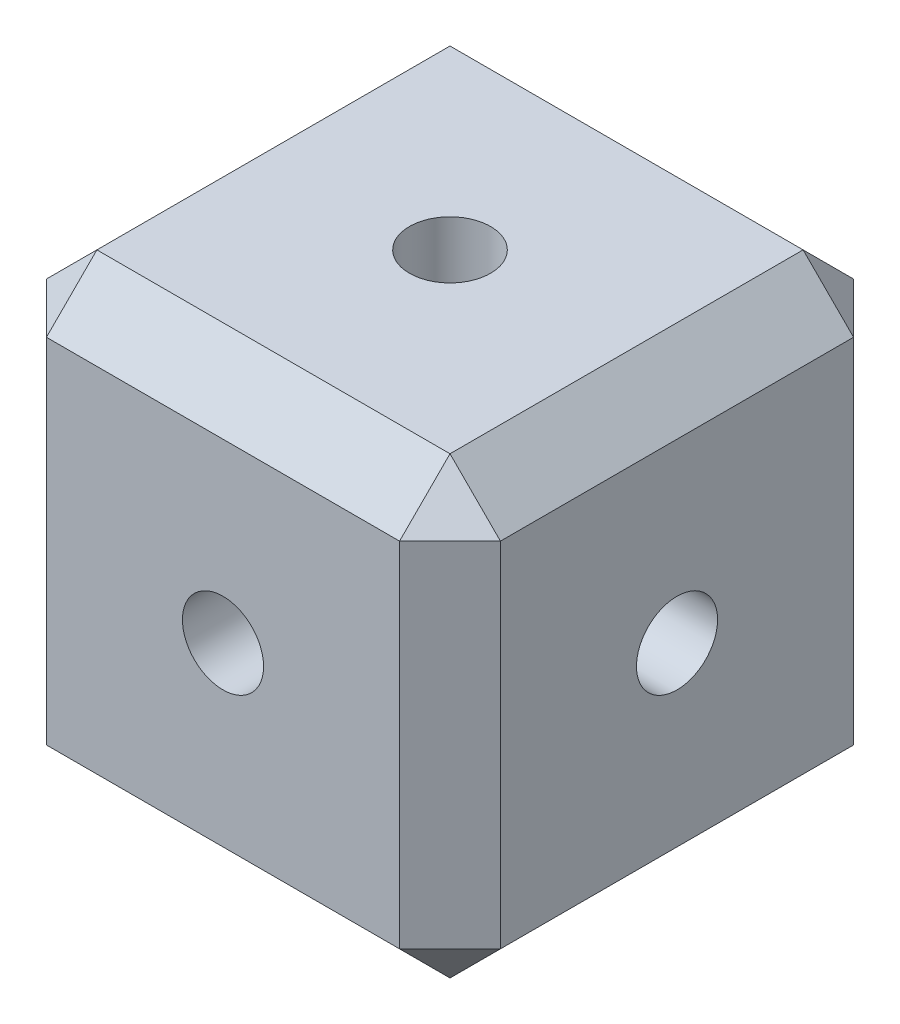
ISO-10303-21;
HEADER;
FILE_DESCRIPTION(('STEP AP214'),'2;1');
FILE_NAME('part.step','',(''),(''),'','','');
FILE_SCHEMA(('AUTOMOTIVE_DESIGN { 1 0 10303 214 1 1 1 1 }'));
ENDSEC;
DATA;
#1=APPLICATION_CONTEXT('core data for automotive mechanical design processes');
#2=APPLICATION_PROTOCOL_DEFINITION('international standard','automotive_design',2000,#1);
#3=PRODUCT_CONTEXT('',#1,'mechanical');
#4=PRODUCT('Part','Part','',(#3));
#5=PRODUCT_RELATED_PRODUCT_CATEGORY('part','',(#4));
#6=PRODUCT_DEFINITION_FORMATION('','',#4);
#7=PRODUCT_DEFINITION_CONTEXT('part definition',#1,'design');
#8=PRODUCT_DEFINITION('design','',#6,#7);
#9=PRODUCT_DEFINITION_SHAPE('','',#8);
#10=(LENGTH_UNIT() NAMED_UNIT(*) SI_UNIT(.MILLI.,.METRE.));
#11=(NAMED_UNIT(*) PLANE_ANGLE_UNIT() SI_UNIT($,.RADIAN.));
#12=(NAMED_UNIT(*) SI_UNIT($,.STERADIAN.) SOLID_ANGLE_UNIT());
#13=UNCERTAINTY_MEASURE_WITH_UNIT(LENGTH_MEASURE(1.E-05),#10,'distance_accuracy_value','');
#14=(GEOMETRIC_REPRESENTATION_CONTEXT(3) GLOBAL_UNCERTAINTY_ASSIGNED_CONTEXT((#13)) GLOBAL_UNIT_ASSIGNED_CONTEXT((#10,
#11,#12)) REPRESENTATION_CONTEXT('',''));
#15=CARTESIAN_POINT('',(0.,0.,0.));
#16=DIRECTION('',(0.,0.,1.));
#17=DIRECTION('',(1.,0.,0.));
#18=AXIS2_PLACEMENT_3D('',#15,#16,#17);
#19=CARTESIAN_POINT('',(14.2875,0.,0.));
#20=DIRECTION('',(1.,0.,0.));
#21=DIRECTION('',(0.,0.,-1.));
#22=AXIS2_PLACEMENT_3D('',#19,#20,#21);
#23=CYLINDRICAL_SURFACE('',#22,2.55269999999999);
#24=CARTESIAN_POINT('',(14.2875,0.,0.));
#25=DIRECTION('',(1.,0.,0.));
#26=DIRECTION('',(0.,0.,-1.));
#27=AXIS2_PLACEMENT_3D('',#24,#25,#26);
#28=CIRCLE('',#27,2.55269999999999);
#29=CARTESIAN_POINT('',(14.2875,0.,-2.55269999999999));
#30=VERTEX_POINT('',#29);
#31=EDGE_CURVE('E376',#30,#30,#28,.T.);
#32=ORIENTED_EDGE('',*,*,#31,.T.);
#33=EDGE_LOOP('',(#32));
#34=FACE_BOUND('',#33,.T.);
#35=CARTESIAN_POINT('',(0.,0.,0.));
#36=DIRECTION('',(0.707106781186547,0.,0.707106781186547));
#37=DIRECTION('',(0.707106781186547,0.,-0.707106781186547));
#38=AXIS2_PLACEMENT_3D('',#35,#36,#37);
#39=ELLIPSE('',#38,3.61006296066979,2.55269999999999);
#40=CARTESIAN_POINT('',(1.80503148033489,1.80503148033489,-1.80503148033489));
#41=VERTEX_POINT('',#40);
#42=CARTESIAN_POINT('',(1.80503148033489,-1.80503148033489,-1.80503148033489));
#43=VERTEX_POINT('',#42);
#44=EDGE_CURVE('E144',#41,#43,#39,.F.);
#45=ORIENTED_EDGE('',*,*,#44,.T.);
#46=CARTESIAN_POINT('',(0.,0.,0.));
#47=DIRECTION('',(0.707106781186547,0.707106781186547,0.));
#48=DIRECTION('',(0.707106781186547,-0.707106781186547,0.));
#49=AXIS2_PLACEMENT_3D('',#46,#47,#48);
#50=ELLIPSE('',#49,3.61006296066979,2.55269999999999);
#51=CARTESIAN_POINT('',(1.80503148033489,-1.80503148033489,1.80503148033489));
#52=VERTEX_POINT('',#51);
#53=EDGE_CURVE('E137',#43,#52,#50,.F.);
#54=ORIENTED_EDGE('',*,*,#53,.T.);
#55=CARTESIAN_POINT('',(0.,0.,0.));
#56=DIRECTION('',(0.707106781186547,0.,-0.707106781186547));
#57=DIRECTION('',(0.707106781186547,0.,0.707106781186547));
#58=AXIS2_PLACEMENT_3D('',#55,#56,#57);
#59=ELLIPSE('',#58,3.61006296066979,2.55269999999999);
#60=CARTESIAN_POINT('',(1.80503148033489,1.80503148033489,1.80503148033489));
#61=VERTEX_POINT('',#60);
#62=EDGE_CURVE('E161',#52,#61,#59,.F.);
#63=ORIENTED_EDGE('',*,*,#62,.T.);
#64=CARTESIAN_POINT('',(0.,0.,0.));
#65=DIRECTION('',(0.707106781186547,-0.707106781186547,0.));
#66=DIRECTION('',(0.707106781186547,0.707106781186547,0.));
#67=AXIS2_PLACEMENT_3D('',#64,#65,#66);
#68=ELLIPSE('',#67,3.61006296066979,2.55269999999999);
#69=EDGE_CURVE('E361',#61,#41,#68,.F.);
#70=ORIENTED_EDGE('',*,*,#69,.T.);
#71=EDGE_LOOP('',(#45,#54,#63,#70));
#72=FACE_BOUND('',#71,.T.);
#73=ADVANCED_FACE('F15',(#34,#72),#23,.F.);
#74=CARTESIAN_POINT('',(-14.2875,14.2875,14.2875));
#75=DIRECTION('',(1.,0.,0.));
#76=DIRECTION('',(0.,1.,0.));
#77=AXIS2_PLACEMENT_3D('',#74,#75,#76);
#78=PLANE('',#77);
#79=DIRECTION('',(0.,0.,-1.));
#80=VECTOR('',#79,1.);
#81=CARTESIAN_POINT('',(-14.2875,11.1125,14.2875));
#82=LINE('',#81,#80);
#83=CARTESIAN_POINT('',(-14.2875,11.1125,11.1125));
#84=VERTEX_POINT('',#83);
#85=CARTESIAN_POINT('',(-14.2875,11.1125,-11.1125));
#86=VERTEX_POINT('',#85);
#87=EDGE_CURVE('E178',#84,#86,#82,.T.);
#88=ORIENTED_EDGE('',*,*,#87,.T.);
#89=DIRECTION('',(0.,-1.,0.));
#90=VECTOR('',#89,1.);
#91=CARTESIAN_POINT('',(-14.2875,14.2875,-11.1125));
#92=LINE('',#91,#90);
#93=CARTESIAN_POINT('',(-14.2875,-11.1125,-11.1125));
#94=VERTEX_POINT('',#93);
#95=EDGE_CURVE('E187',#86,#94,#92,.T.);
#96=ORIENTED_EDGE('',*,*,#95,.T.);
#97=DIRECTION('',(0.,0.,1.));
#98=VECTOR('',#97,1.);
#99=CARTESIAN_POINT('',(-14.2875,-11.1125,14.2875));
#100=LINE('',#99,#98);
#101=CARTESIAN_POINT('',(-14.2875,-11.1125,11.1125));
#102=VERTEX_POINT('',#101);
#103=EDGE_CURVE('E184',#94,#102,#100,.T.);
#104=ORIENTED_EDGE('',*,*,#103,.T.);
#105=DIRECTION('',(0.,1.,0.));
#106=VECTOR('',#105,1.);
#107=CARTESIAN_POINT('',(-14.2875,14.2875,11.1125));
#108=LINE('',#107,#106);
#109=EDGE_CURVE('E181',#102,#84,#108,.T.);
#110=ORIENTED_EDGE('',*,*,#109,.T.);
#111=EDGE_LOOP('',(#88,#96,#104,#110));
#112=FACE_BOUND('',#111,.T.);
#113=CARTESIAN_POINT('',(-14.2875,0.,0.));
#114=DIRECTION('',(1.,0.,0.));
#115=DIRECTION('',(0.,0.,-1.));
#116=AXIS2_PLACEMENT_3D('',#113,#114,#115);
#117=CIRCLE('',#116,2.55269999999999);
#118=CARTESIAN_POINT('',(-14.2875,0.,-2.55269999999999));
#119=VERTEX_POINT('',#118);
#120=EDGE_CURVE('E170',#119,#119,#117,.T.);
#121=ORIENTED_EDGE('',*,*,#120,.T.);
#122=EDGE_LOOP('',(#121));
#123=FACE_BOUND('',#122,.T.);
#124=ADVANCED_FACE('F383',(#112,#123),#78,.F.);
#125=CARTESIAN_POINT('',(-14.2875,-14.2875,14.2875));
#126=DIRECTION('',(0.,1.,0.));
#127=DIRECTION('',(-1.,0.,0.));
#128=AXIS2_PLACEMENT_3D('',#125,#126,#127);
#129=PLANE('',#128);
#130=DIRECTION('',(-1.,0.,0.));
#131=VECTOR('',#130,1.);
#132=CARTESIAN_POINT('',(-14.2875,-14.2875,11.1125));
#133=LINE('',#132,#131);
#134=CARTESIAN_POINT('',(11.1125,-14.2875,11.1125));
#135=VERTEX_POINT('',#134);
#136=CARTESIAN_POINT('',(-11.1125,-14.2875,11.1125));
#137=VERTEX_POINT('',#136);
#138=EDGE_CURVE('E207',#135,#137,#133,.T.);
#139=ORIENTED_EDGE('',*,*,#138,.T.);
#140=DIRECTION('',(0.,0.,-1.));
#141=VECTOR('',#140,1.);
#142=CARTESIAN_POINT('',(-11.1125,-14.2875,14.2875));
#143=LINE('',#142,#141);
#144=CARTESIAN_POINT('',(-11.1125,-14.2875,-11.1125));
#145=VERTEX_POINT('',#144);
#146=EDGE_CURVE('E213',#137,#145,#143,.T.);
#147=ORIENTED_EDGE('',*,*,#146,.T.);
#148=DIRECTION('',(1.,0.,0.));
#149=VECTOR('',#148,1.);
#150=CARTESIAN_POINT('',(-14.2875,-14.2875,-11.1125));
#151=LINE('',#150,#149);
#152=CARTESIAN_POINT('',(11.1125,-14.2875,-11.1125));
#153=VERTEX_POINT('',#152);
#154=EDGE_CURVE('E210',#145,#153,#151,.T.);
#155=ORIENTED_EDGE('',*,*,#154,.T.);
#156=DIRECTION('',(0.,0.,1.));
#157=VECTOR('',#156,1.);
#158=CARTESIAN_POINT('',(11.1125,-14.2875,14.2875));
#159=LINE('',#158,#157);
#160=EDGE_CURVE('E204',#153,#135,#159,.T.);
#161=ORIENTED_EDGE('',*,*,#160,.T.);
#162=EDGE_LOOP('',(#139,#147,#155,#161));
#163=FACE_BOUND('',#162,.T.);
#164=CARTESIAN_POINT('',(0.,-14.2875,0.));
#165=DIRECTION('',(0.,1.,0.));
#166=DIRECTION('',(0.,0.,1.));
#167=AXIS2_PLACEMENT_3D('',#164,#165,#166);
#168=CIRCLE('',#167,2.55269999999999);
#169=CARTESIAN_POINT('',(0.,-14.2875,2.55269999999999));
#170=VERTEX_POINT('',#169);
#171=EDGE_CURVE('E156',#170,#170,#168,.T.);
#172=ORIENTED_EDGE('',*,*,#171,.T.);
#173=EDGE_LOOP('',(#172));
#174=FACE_BOUND('',#173,.T.);
#175=ADVANCED_FACE('F402',(#163,#174),#129,.F.);
#176=CARTESIAN_POINT('',(14.2875,14.2875,14.2875));
#177=DIRECTION('',(-1.,0.,0.));
#178=DIRECTION('',(0.,-1.,0.));
#179=AXIS2_PLACEMENT_3D('',#176,#177,#178);
#180=PLANE('',#179);
#181=DIRECTION('',(0.,-1.,0.));
#182=VECTOR('',#181,1.);
#183=CARTESIAN_POINT('',(14.2875,-14.2875,11.1125));
#184=LINE('',#183,#182);
#185=CARTESIAN_POINT('',(14.2875,11.1125,11.1125));
#186=VERTEX_POINT('',#185);
#187=CARTESIAN_POINT('',(14.2875,-11.1125,11.1125));
#188=VERTEX_POINT('',#187);
#189=EDGE_CURVE('E230',#186,#188,#184,.T.);
#190=ORIENTED_EDGE('',*,*,#189,.T.);
#191=DIRECTION('',(0.,0.,-1.));
#192=VECTOR('',#191,1.);
#193=CARTESIAN_POINT('',(14.2875,-11.1125,14.2875));
#194=LINE('',#193,#192);
#195=CARTESIAN_POINT('',(14.2875,-11.1125,-11.1125));
#196=VERTEX_POINT('',#195);
#197=EDGE_CURVE('E239',#188,#196,#194,.T.);
#198=ORIENTED_EDGE('',*,*,#197,.T.);
#199=DIRECTION('',(0.,1.,0.));
#200=VECTOR('',#199,1.);
#201=CARTESIAN_POINT('',(14.2875,14.2875,-11.1125));
#202=LINE('',#201,#200);
#203=CARTESIAN_POINT('',(14.2875,11.1125,-11.1125));
#204=VERTEX_POINT('',#203);
#205=EDGE_CURVE('E236',#196,#204,#202,.T.);
#206=ORIENTED_EDGE('',*,*,#205,.T.);
#207=DIRECTION('',(0.,0.,1.));
#208=VECTOR('',#207,1.);
#209=CARTESIAN_POINT('',(14.2875,11.1125,14.2875));
#210=LINE('',#209,#208);
#211=EDGE_CURVE('E233',#204,#186,#210,.T.);
#212=ORIENTED_EDGE('',*,*,#211,.T.);
#213=EDGE_LOOP('',(#190,#198,#206,#212));
#214=FACE_BOUND('',#213,.T.);
#215=ORIENTED_EDGE('',*,*,#31,.F.);
#216=EDGE_LOOP('',(#215));
#217=FACE_BOUND('',#216,.T.);
#218=ADVANCED_FACE('F465',(#214,#217),#180,.F.);
#219=CARTESIAN_POINT('',(-14.2875,14.2875,14.2875));
#220=DIRECTION('',(0.,-1.,0.));
#221=DIRECTION('',(0.,0.,-1.));
#222=AXIS2_PLACEMENT_3D('',#219,#220,#221);
#223=PLANE('',#222);
#224=DIRECTION('',(0.,0.,-1.));
#225=VECTOR('',#224,1.);
#226=CARTESIAN_POINT('',(11.1125,14.2875,14.2875));
#227=LINE('',#226,#225);
#228=CARTESIAN_POINT('',(11.1125,14.2875,11.1125));
#229=VERTEX_POINT('',#228);
#230=CARTESIAN_POINT('',(11.1125,14.2875,-11.1125));
#231=VERTEX_POINT('',#230);
#232=EDGE_CURVE('E25',#229,#231,#227,.T.);
#233=ORIENTED_EDGE('',*,*,#232,.T.);
#234=DIRECTION('',(-1.,0.,0.));
#235=VECTOR('',#234,1.);
#236=CARTESIAN_POINT('',(-14.2875,14.2875,-11.1125));
#237=LINE('',#236,#235);
#238=CARTESIAN_POINT('',(-11.1125,14.2875,-11.1125));
#239=VERTEX_POINT('',#238);
#240=EDGE_CURVE('E10',#231,#239,#237,.T.);
#241=ORIENTED_EDGE('',*,*,#240,.T.);
#242=DIRECTION('',(0.,0.,1.));
#243=VECTOR('',#242,1.);
#244=CARTESIAN_POINT('',(-11.1125,14.2875,14.2875));
#245=LINE('',#244,#243);
#246=CARTESIAN_POINT('',(-11.1125,14.2875,11.1125));
#247=VERTEX_POINT('',#246);
#248=EDGE_CURVE('E246',#239,#247,#245,.T.);
#249=ORIENTED_EDGE('',*,*,#248,.T.);
#250=DIRECTION('',(1.,0.,0.));
#251=VECTOR('',#250,1.);
#252=CARTESIAN_POINT('',(14.2875,14.2875,11.1125));
#253=LINE('',#252,#251);
#254=EDGE_CURVE('E243',#247,#229,#253,.T.);
#255=ORIENTED_EDGE('',*,*,#254,.T.);
#256=EDGE_LOOP('',(#233,#241,#249,#255));
#257=FACE_BOUND('',#256,.T.);
#258=CARTESIAN_POINT('',(0.,14.2875,0.));
#259=DIRECTION('',(0.,1.,0.));
#260=DIRECTION('',(0.,0.,1.));
#261=AXIS2_PLACEMENT_3D('',#258,#259,#260);
#262=CIRCLE('',#261,2.55269999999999);
#263=CARTESIAN_POINT('',(0.,14.2875,2.55269999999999));
#264=VERTEX_POINT('',#263);
#265=EDGE_CURVE('E339',#264,#264,#262,.T.);
#266=ORIENTED_EDGE('',*,*,#265,.F.);
#267=EDGE_LOOP('',(#266));
#268=FACE_BOUND('',#267,.T.);
#269=ADVANCED_FACE('F455',(#257,#268),#223,.F.);
#270=CARTESIAN_POINT('',(0.,0.,14.2875));
#271=DIRECTION('',(0.,0.,1.));
#272=DIRECTION('',(1.,0.,0.));
#273=AXIS2_PLACEMENT_3D('',#270,#271,#272);
#274=PLANE('',#273);
#275=DIRECTION('',(0.,-1.,0.));
#276=VECTOR('',#275,1.);
#277=CARTESIAN_POINT('',(-11.1125,-14.2875,14.2875));
#278=LINE('',#277,#276);
#279=CARTESIAN_POINT('',(-11.1125,11.1125,14.2875));
#280=VERTEX_POINT('',#279);
#281=CARTESIAN_POINT('',(-11.1125,-11.1125,14.2875));
#282=VERTEX_POINT('',#281);
#283=EDGE_CURVE('E220',#280,#282,#278,.T.);
#284=ORIENTED_EDGE('',*,*,#283,.T.);
#285=DIRECTION('',(1.,0.,0.));
#286=VECTOR('',#285,1.);
#287=CARTESIAN_POINT('',(14.2875,-11.1125,14.2875));
#288=LINE('',#287,#286);
#289=CARTESIAN_POINT('',(11.1125,-11.1125,14.2875));
#290=VERTEX_POINT('',#289);
#291=EDGE_CURVE('E226',#282,#290,#288,.T.);
#292=ORIENTED_EDGE('',*,*,#291,.T.);
#293=DIRECTION('',(0.,1.,0.));
#294=VECTOR('',#293,1.);
#295=CARTESIAN_POINT('',(11.1125,14.2875,14.2875));
#296=LINE('',#295,#294);
#297=CARTESIAN_POINT('',(11.1125,11.1125,14.2875));
#298=VERTEX_POINT('',#297);
#299=EDGE_CURVE('E223',#290,#298,#296,.T.);
#300=ORIENTED_EDGE('',*,*,#299,.T.);
#301=DIRECTION('',(-1.,0.,0.));
#302=VECTOR('',#301,1.);
#303=CARTESIAN_POINT('',(-14.2875,11.1125,14.2875));
#304=LINE('',#303,#302);
#305=EDGE_CURVE('E217',#298,#280,#304,.T.);
#306=ORIENTED_EDGE('',*,*,#305,.T.);
#307=EDGE_LOOP('',(#284,#292,#300,#306));
#308=FACE_BOUND('',#307,.T.);
#309=CARTESIAN_POINT('',(0.,0.,14.2875));
#310=DIRECTION('',(0.,0.,1.));
#311=DIRECTION('',(1.,0.,0.));
#312=AXIS2_PLACEMENT_3D('',#309,#310,#311);
#313=CIRCLE('',#312,2.55269999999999);
#314=CARTESIAN_POINT('',(2.55269999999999,0.,14.2875));
#315=VERTEX_POINT('',#314);
#316=EDGE_CURVE('E369',#315,#315,#313,.T.);
#317=ORIENTED_EDGE('',*,*,#316,.F.);
#318=EDGE_LOOP('',(#317));
#319=FACE_BOUND('',#318,.T.);
#320=ADVANCED_FACE('F394',(#308,#319),#274,.T.);
#321=CARTESIAN_POINT('',(0.,0.,-14.2875));
#322=DIRECTION('',(0.,0.,1.));
#323=DIRECTION('',(1.,0.,0.));
#324=AXIS2_PLACEMENT_3D('',#321,#322,#323);
#325=PLANE('',#324);
#326=DIRECTION('',(-1.,0.,0.));
#327=VECTOR('',#326,1.);
#328=CARTESIAN_POINT('',(0.,-11.1125,-14.2875));
#329=LINE('',#328,#327);
#330=CARTESIAN_POINT('',(11.1125,-11.1125,-14.2875));
#331=VERTEX_POINT('',#330);
#332=CARTESIAN_POINT('',(-11.1125,-11.1125,-14.2875));
#333=VERTEX_POINT('',#332);
#334=EDGE_CURVE('E197',#331,#333,#329,.T.);
#335=ORIENTED_EDGE('',*,*,#334,.T.);
#336=DIRECTION('',(0.,1.,0.));
#337=VECTOR('',#336,1.);
#338=CARTESIAN_POINT('',(-11.1125,0.,-14.2875));
#339=LINE('',#338,#337);
#340=CARTESIAN_POINT('',(-11.1125,11.1125,-14.2875));
#341=VERTEX_POINT('',#340);
#342=EDGE_CURVE('E200',#333,#341,#339,.T.);
#343=ORIENTED_EDGE('',*,*,#342,.T.);
#344=DIRECTION('',(1.,0.,0.));
#345=VECTOR('',#344,1.);
#346=CARTESIAN_POINT('',(0.,11.1125,-14.2875));
#347=LINE('',#346,#345);
#348=CARTESIAN_POINT('',(11.1125,11.1125,-14.2875));
#349=VERTEX_POINT('',#348);
#350=EDGE_CURVE('E191',#341,#349,#347,.T.);
#351=ORIENTED_EDGE('',*,*,#350,.T.);
#352=DIRECTION('',(0.,-1.,0.));
#353=VECTOR('',#352,1.);
#354=CARTESIAN_POINT('',(11.1125,0.,-14.2875));
#355=LINE('',#354,#353);
#356=EDGE_CURVE('E194',#349,#331,#355,.T.);
#357=ORIENTED_EDGE('',*,*,#356,.T.);
#358=EDGE_LOOP('',(#335,#343,#351,#357));
#359=FACE_BOUND('',#358,.T.);
#360=CARTESIAN_POINT('',(0.,0.,-14.2875));
#361=DIRECTION('',(0.,0.,1.));
#362=DIRECTION('',(1.,0.,0.));
#363=AXIS2_PLACEMENT_3D('',#360,#361,#362);
#364=CIRCLE('',#363,2.55269999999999);
#365=CARTESIAN_POINT('',(2.55269999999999,0.,-14.2875));
#366=VERTEX_POINT('',#365);
#367=EDGE_CURVE('E373',#366,#366,#364,.T.);
#368=ORIENTED_EDGE('',*,*,#367,.T.);
#369=EDGE_LOOP('',(#368));
#370=FACE_BOUND('',#369,.T.);
#371=ADVANCED_FACE('F386',(#359,#370),#325,.F.);
#372=CARTESIAN_POINT('',(0.,0.,0.));
#373=DIRECTION('',(0.707106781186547,0.,-0.707106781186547));
#374=DIRECTION('',(0.707106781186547,0.,0.707106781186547));
#375=AXIS2_PLACEMENT_3D('',#372,#373,#374);
#376=ELLIPSE('',#375,3.61006296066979,2.55269999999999);
#377=CARTESIAN_POINT('',(-1.80503148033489,-1.80503148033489,-1.80503148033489));
#378=VERTEX_POINT('',#377);
#379=CARTESIAN_POINT('',(-1.80503148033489,1.80503148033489,-1.80503148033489));
#380=VERTEX_POINT('',#379);
#381=EDGE_CURVE('E152',#378,#380,#376,.T.);
#382=ORIENTED_EDGE('',*,*,#381,.T.);
#383=CARTESIAN_POINT('',(0.,0.,0.));
#384=DIRECTION('',(0.707106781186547,0.707106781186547,0.));
#385=DIRECTION('',(0.707106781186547,-0.707106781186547,0.));
#386=AXIS2_PLACEMENT_3D('',#383,#384,#385);
#387=ELLIPSE('',#386,3.61006296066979,2.55269999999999);
#388=CARTESIAN_POINT('',(-1.80503148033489,1.80503148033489,1.80503148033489));
#389=VERTEX_POINT('',#388);
#390=EDGE_CURVE('E358',#380,#389,#387,.T.);
#391=ORIENTED_EDGE('',*,*,#390,.T.);
#392=CARTESIAN_POINT('',(0.,0.,0.));
#393=DIRECTION('',(0.707106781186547,0.,0.707106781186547));
#394=DIRECTION('',(0.707106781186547,0.,-0.707106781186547));
#395=AXIS2_PLACEMENT_3D('',#392,#393,#394);
#396=ELLIPSE('',#395,3.61006296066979,2.55269999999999);
#397=CARTESIAN_POINT('',(-1.80503148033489,-1.80503148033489,1.80503148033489));
#398=VERTEX_POINT('',#397);
#399=EDGE_CURVE('E154',#389,#398,#396,.T.);
#400=ORIENTED_EDGE('',*,*,#399,.T.);
#401=CARTESIAN_POINT('',(0.,0.,0.));
#402=DIRECTION('',(0.707106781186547,-0.707106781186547,0.));
#403=DIRECTION('',(0.707106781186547,0.707106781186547,0.));
#404=AXIS2_PLACEMENT_3D('',#401,#402,#403);
#405=ELLIPSE('',#404,3.61006296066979,2.55269999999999);
#406=EDGE_CURVE('E134',#398,#378,#405,.T.);
#407=ORIENTED_EDGE('',*,*,#406,.T.);
#408=EDGE_LOOP('',(#382,#391,#400,#407));
#409=FACE_BOUND('',#408,.T.);
#410=ORIENTED_EDGE('',*,*,#120,.F.);
#411=EDGE_LOOP('',(#410));
#412=FACE_BOUND('',#411,.T.);
#413=ADVANCED_FACE('F149',(#409,#412),#23,.F.);
#414=CARTESIAN_POINT('',(0.,0.,14.2875));
#415=DIRECTION('',(0.,0.,1.));
#416=DIRECTION('',(1.,0.,0.));
#417=AXIS2_PLACEMENT_3D('',#414,#415,#416);
#418=CYLINDRICAL_SURFACE('',#417,2.55269999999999);
#419=ORIENTED_EDGE('',*,*,#316,.T.);
#420=EDGE_LOOP('',(#419));
#421=FACE_BOUND('',#420,.T.);
#422=ORIENTED_EDGE('',*,*,#62,.F.);
#423=CARTESIAN_POINT('',(0.,0.,0.));
#424=DIRECTION('',(0.,0.707106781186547,0.707106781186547));
#425=DIRECTION('',(0.,-0.707106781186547,0.707106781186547));
#426=AXIS2_PLACEMENT_3D('',#423,#424,#425);
#427=ELLIPSE('',#426,3.61006296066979,2.55269999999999);
#428=EDGE_CURVE('E355',#52,#398,#427,.F.);
#429=ORIENTED_EDGE('',*,*,#428,.T.);
#430=ORIENTED_EDGE('',*,*,#399,.F.);
#431=CARTESIAN_POINT('',(0.,0.,0.));
#432=DIRECTION('',(0.,-0.707106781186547,0.707106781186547));
#433=DIRECTION('',(0.,0.707106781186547,0.707106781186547));
#434=AXIS2_PLACEMENT_3D('',#431,#432,#433);
#435=ELLIPSE('',#434,3.61006296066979,2.55269999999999);
#436=EDGE_CURVE('E365',#389,#61,#435,.F.);
#437=ORIENTED_EDGE('',*,*,#436,.T.);
#438=EDGE_LOOP('',(#422,#429,#430,#437));
#439=FACE_BOUND('',#438,.T.);
#440=ADVANCED_FACE('F385',(#421,#439),#418,.F.);
#441=ORIENTED_EDGE('',*,*,#367,.F.);
#442=EDGE_LOOP('',(#441));
#443=FACE_BOUND('',#442,.T.);
#444=ORIENTED_EDGE('',*,*,#44,.F.);
#445=CARTESIAN_POINT('',(0.,0.,0.));
#446=DIRECTION('',(0.,0.707106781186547,0.707106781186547));
#447=DIRECTION('',(0.,-0.707106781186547,0.707106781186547));
#448=AXIS2_PLACEMENT_3D('',#445,#446,#447);
#449=ELLIPSE('',#448,3.61006296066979,2.55269999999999);
#450=EDGE_CURVE('E143',#41,#380,#449,.T.);
#451=ORIENTED_EDGE('',*,*,#450,.T.);
#452=ORIENTED_EDGE('',*,*,#381,.F.);
#453=CARTESIAN_POINT('',(0.,0.,0.));
#454=DIRECTION('',(0.,-0.707106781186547,0.707106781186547));
#455=DIRECTION('',(0.,0.707106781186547,0.707106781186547));
#456=AXIS2_PLACEMENT_3D('',#453,#454,#455);
#457=ELLIPSE('',#456,3.61006296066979,2.55269999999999);
#458=EDGE_CURVE('E131',#378,#43,#457,.T.);
#459=ORIENTED_EDGE('',*,*,#458,.T.);
#460=EDGE_LOOP('',(#444,#451,#452,#459));
#461=FACE_BOUND('',#460,.T.);
#462=ADVANCED_FACE('F159',(#443,#461),#418,.F.);
#463=CARTESIAN_POINT('',(0.,14.2875,0.));
#464=DIRECTION('',(0.,1.,0.));
#465=DIRECTION('',(0.,0.,1.));
#466=AXIS2_PLACEMENT_3D('',#463,#464,#465);
#467=CYLINDRICAL_SURFACE('',#466,2.55269999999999);
#468=ORIENTED_EDGE('',*,*,#265,.T.);
#469=EDGE_LOOP('',(#468));
#470=FACE_BOUND('',#469,.T.);
#471=ORIENTED_EDGE('',*,*,#390,.F.);
#472=ORIENTED_EDGE('',*,*,#450,.F.);
#473=ORIENTED_EDGE('',*,*,#69,.F.);
#474=ORIENTED_EDGE('',*,*,#436,.F.);
#475=EDGE_LOOP('',(#471,#472,#473,#474));
#476=FACE_BOUND('',#475,.T.);
#477=ADVANCED_FACE('F409',(#470,#476),#467,.F.);
#478=ORIENTED_EDGE('',*,*,#171,.F.);
#479=EDGE_LOOP('',(#478));
#480=FACE_BOUND('',#479,.T.);
#481=ORIENTED_EDGE('',*,*,#53,.F.);
#482=ORIENTED_EDGE('',*,*,#458,.F.);
#483=ORIENTED_EDGE('',*,*,#406,.F.);
#484=ORIENTED_EDGE('',*,*,#428,.F.);
#485=EDGE_LOOP('',(#481,#482,#483,#484));
#486=FACE_BOUND('',#485,.T.);
#487=ADVANCED_FACE('F133',(#480,#486),#467,.F.);
#488=CARTESIAN_POINT('',(11.1125,0.,14.2875));
#489=DIRECTION('',(0.707106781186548,0.,0.707106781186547));
#490=DIRECTION('',(0.,-1.,0.));
#491=AXIS2_PLACEMENT_3D('',#488,#489,#490);
#492=PLANE('',#491);
#493=DIRECTION('',(0.707106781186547,0.,-0.707106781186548));
#494=VECTOR('',#493,1.);
#495=CARTESIAN_POINT('',(14.2875,11.1125,11.1125));
#496=LINE('',#495,#494);
#497=EDGE_CURVE('E19',#298,#186,#496,.T.);
#498=ORIENTED_EDGE('',*,*,#497,.F.);
#499=ORIENTED_EDGE('',*,*,#299,.F.);
#500=DIRECTION('',(-0.707106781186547,0.,0.707106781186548));
#501=VECTOR('',#500,1.);
#502=CARTESIAN_POINT('',(11.1125,-11.1125,14.2875));
#503=LINE('',#502,#501);
#504=EDGE_CURVE('E329',#188,#290,#503,.T.);
#505=ORIENTED_EDGE('',*,*,#504,.F.);
#506=ORIENTED_EDGE('',*,*,#189,.F.);
#507=EDGE_LOOP('',(#498,#499,#505,#506));
#508=FACE_BOUND('',#507,.T.);
#509=ADVANCED_FACE('F17',(#508),#492,.T.);
#510=CARTESIAN_POINT('',(14.2875,11.1125,11.1125));
#511=DIRECTION('',(0.577350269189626,0.577350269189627,0.577350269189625));
#512=DIRECTION('',(-0.707106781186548,0.707106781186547,0.));
#513=AXIS2_PLACEMENT_3D('',#510,#511,#512);
#514=PLANE('',#513);
#515=DIRECTION('',(0.,-0.707106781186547,0.707106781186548));
#516=VECTOR('',#515,1.);
#517=CARTESIAN_POINT('',(11.1125,12.7,12.7));
#518=LINE('',#517,#516);
#519=EDGE_CURVE('E322',#298,#229,#518,.F.);
#520=ORIENTED_EDGE('',*,*,#519,.F.);
#521=ORIENTED_EDGE('',*,*,#497,.T.);
#522=DIRECTION('',(0.707106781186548,-0.707106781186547,0.));
#523=VECTOR('',#522,1.);
#524=CARTESIAN_POINT('',(14.2875,11.1125,11.1125));
#525=LINE('',#524,#523);
#526=EDGE_CURVE('E326',#229,#186,#525,.T.);
#527=ORIENTED_EDGE('',*,*,#526,.F.);
#528=EDGE_LOOP('',(#520,#521,#527));
#529=FACE_BOUND('',#528,.T.);
#530=ADVANCED_FACE('F732',(#529),#514,.T.);
#531=CARTESIAN_POINT('',(11.1125,-11.1125,14.2875));
#532=DIRECTION('',(0.577350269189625,-0.577350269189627,0.577350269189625));
#533=DIRECTION('',(0.707106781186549,0.707106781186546,0.));
#534=AXIS2_PLACEMENT_3D('',#531,#532,#533);
#535=PLANE('',#534);
#536=DIRECTION('',(-0.707106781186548,-0.707106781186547,0.));
#537=VECTOR('',#536,1.);
#538=CARTESIAN_POINT('',(12.7,-12.7,11.1125));
#539=LINE('',#538,#537);
#540=EDGE_CURVE('E315',#188,#135,#539,.T.);
#541=ORIENTED_EDGE('',*,*,#540,.F.);
#542=ORIENTED_EDGE('',*,*,#504,.T.);
#543=DIRECTION('',(0.,-0.707106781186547,-0.707106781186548));
#544=VECTOR('',#543,1.);
#545=CARTESIAN_POINT('',(11.1125,-11.1125,14.2875));
#546=LINE('',#545,#544);
#547=EDGE_CURVE('E319',#135,#290,#546,.F.);
#548=ORIENTED_EDGE('',*,*,#547,.F.);
#549=EDGE_LOOP('',(#541,#542,#548));
#550=FACE_BOUND('',#549,.T.);
#551=ADVANCED_FACE('F719',(#550),#535,.T.);
#552=CARTESIAN_POINT('',(11.1125,14.2875,14.2875));
#553=DIRECTION('',(-0.707106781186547,-0.707106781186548,0.));
#554=DIRECTION('',(0.,0.,-1.));
#555=AXIS2_PLACEMENT_3D('',#552,#553,#554);
#556=PLANE('',#555);
#557=ORIENTED_EDGE('',*,*,#526,.T.);
#558=ORIENTED_EDGE('',*,*,#211,.F.);
#559=DIRECTION('',(-0.707106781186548,0.707106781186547,0.));
#560=VECTOR('',#559,1.);
#561=CARTESIAN_POINT('',(14.2875,11.1125,-11.1125));
#562=LINE('',#561,#560);
#563=EDGE_CURVE('E308',#231,#204,#562,.F.);
#564=ORIENTED_EDGE('',*,*,#563,.F.);
#565=ORIENTED_EDGE('',*,*,#232,.F.);
#566=EDGE_LOOP('',(#557,#558,#564,#565));
#567=FACE_BOUND('',#566,.T.);
#568=ADVANCED_FACE('F706',(#567),#556,.F.);
#569=CARTESIAN_POINT('',(0.,11.1125,14.2875));
#570=DIRECTION('',(0.,0.707106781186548,0.707106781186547));
#571=DIRECTION('',(1.,0.,0.));
#572=AXIS2_PLACEMENT_3D('',#569,#570,#571);
#573=PLANE('',#572);
#574=ORIENTED_EDGE('',*,*,#519,.T.);
#575=ORIENTED_EDGE('',*,*,#254,.F.);
#576=DIRECTION('',(0.,0.707106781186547,-0.707106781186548));
#577=VECTOR('',#576,1.);
#578=CARTESIAN_POINT('',(-11.1125,12.7,12.7));
#579=LINE('',#578,#577);
#580=EDGE_CURVE('E304',#280,#247,#579,.T.);
#581=ORIENTED_EDGE('',*,*,#580,.F.);
#582=ORIENTED_EDGE('',*,*,#305,.F.);
#583=EDGE_LOOP('',(#574,#575,#581,#582));
#584=FACE_BOUND('',#583,.T.);
#585=ADVANCED_FACE('F693',(#584),#573,.T.);
#586=CARTESIAN_POINT('',(-11.1125,0.,14.2875));
#587=DIRECTION('',(-0.707106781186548,0.,0.707106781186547));
#588=DIRECTION('',(0.,1.,0.));
#589=AXIS2_PLACEMENT_3D('',#586,#587,#588);
#590=PLANE('',#589);
#591=DIRECTION('',(-0.707106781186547,0.,-0.707106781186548));
#592=VECTOR('',#591,1.);
#593=CARTESIAN_POINT('',(-14.2875,-11.1125,11.1125));
#594=LINE('',#593,#592);
#595=EDGE_CURVE('E296',#282,#102,#594,.T.);
#596=ORIENTED_EDGE('',*,*,#595,.F.);
#597=ORIENTED_EDGE('',*,*,#283,.F.);
#598=DIRECTION('',(0.707106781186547,0.,0.707106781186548));
#599=VECTOR('',#598,1.);
#600=CARTESIAN_POINT('',(-14.2875,11.1125,11.1125));
#601=LINE('',#600,#599);
#602=EDGE_CURVE('E300',#84,#280,#601,.T.);
#603=ORIENTED_EDGE('',*,*,#602,.F.);
#604=ORIENTED_EDGE('',*,*,#109,.F.);
#605=EDGE_LOOP('',(#596,#597,#603,#604));
#606=FACE_BOUND('',#605,.T.);
#607=ADVANCED_FACE('F680',(#606),#590,.T.);
#608=CARTESIAN_POINT('',(0.,-11.1125,14.2875));
#609=DIRECTION('',(0.,-0.707106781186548,0.707106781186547));
#610=DIRECTION('',(-1.,0.,0.));
#611=AXIS2_PLACEMENT_3D('',#608,#609,#610);
#612=PLANE('',#611);
#613=ORIENTED_EDGE('',*,*,#547,.T.);
#614=ORIENTED_EDGE('',*,*,#291,.F.);
#615=DIRECTION('',(0.,0.707106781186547,0.707106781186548));
#616=VECTOR('',#615,1.);
#617=CARTESIAN_POINT('',(-11.1125,-12.7,12.7));
#618=LINE('',#617,#616);
#619=EDGE_CURVE('E292',#137,#282,#618,.T.);
#620=ORIENTED_EDGE('',*,*,#619,.F.);
#621=ORIENTED_EDGE('',*,*,#138,.F.);
#622=EDGE_LOOP('',(#613,#614,#620,#621));
#623=FACE_BOUND('',#622,.T.);
#624=ADVANCED_FACE('F667',(#623),#612,.T.);
#625=CARTESIAN_POINT('',(14.2875,-11.1125,14.2875));
#626=DIRECTION('',(-0.707106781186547,0.707106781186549,0.));
#627=DIRECTION('',(0.,0.,-1.));
#628=AXIS2_PLACEMENT_3D('',#625,#626,#627);
#629=PLANE('',#628);
#630=ORIENTED_EDGE('',*,*,#540,.T.);
#631=ORIENTED_EDGE('',*,*,#160,.F.);
#632=DIRECTION('',(0.707106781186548,0.707106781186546,0.));
#633=VECTOR('',#632,1.);
#634=CARTESIAN_POINT('',(11.1125,-14.2875,-11.1125));
#635=LINE('',#634,#633);
#636=EDGE_CURVE('E288',#196,#153,#635,.F.);
#637=ORIENTED_EDGE('',*,*,#636,.F.);
#638=ORIENTED_EDGE('',*,*,#197,.F.);
#639=EDGE_LOOP('',(#630,#631,#637,#638));
#640=FACE_BOUND('',#639,.T.);
#641=ADVANCED_FACE('F654',(#640),#629,.F.);
#642=CARTESIAN_POINT('',(14.2875,14.2875,-11.1125));
#643=DIRECTION('',(-0.707106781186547,0.,0.707106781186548));
#644=DIRECTION('',(0.,1.,0.));
#645=AXIS2_PLACEMENT_3D('',#642,#643,#644);
#646=PLANE('',#645);
#647=DIRECTION('',(0.707106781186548,0.,0.707106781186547));
#648=VECTOR('',#647,1.);
#649=CARTESIAN_POINT('',(14.2875,11.1125,-11.1125));
#650=LINE('',#649,#648);
#651=EDGE_CURVE('E311',#204,#349,#650,.F.);
#652=ORIENTED_EDGE('',*,*,#651,.F.);
#653=ORIENTED_EDGE('',*,*,#205,.F.);
#654=DIRECTION('',(-0.707106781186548,0.,-0.707106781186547));
#655=VECTOR('',#654,1.);
#656=CARTESIAN_POINT('',(12.7,-11.1125,-12.7));
#657=LINE('',#656,#655);
#658=EDGE_CURVE('E285',#331,#196,#657,.F.);
#659=ORIENTED_EDGE('',*,*,#658,.F.);
#660=ORIENTED_EDGE('',*,*,#356,.F.);
#661=EDGE_LOOP('',(#652,#653,#659,#660));
#662=FACE_BOUND('',#661,.T.);
#663=ADVANCED_FACE('F641',(#662),#646,.F.);
#664=CARTESIAN_POINT('',(14.2875,11.1125,-11.1125));
#665=DIRECTION('',(0.577350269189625,0.577350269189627,-0.577350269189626));
#666=DIRECTION('',(0.,0.707106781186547,0.707106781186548));
#667=AXIS2_PLACEMENT_3D('',#664,#665,#666);
#668=PLANE('',#667);
#669=ORIENTED_EDGE('',*,*,#563,.T.);
#670=ORIENTED_EDGE('',*,*,#651,.T.);
#671=DIRECTION('',(0.,-0.707106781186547,-0.707106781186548));
#672=VECTOR('',#671,1.);
#673=CARTESIAN_POINT('',(11.1125,12.7,-12.7));
#674=LINE('',#673,#672);
#675=EDGE_CURVE('E281',#231,#349,#674,.T.);
#676=ORIENTED_EDGE('',*,*,#675,.F.);
#677=EDGE_LOOP('',(#669,#670,#676));
#678=FACE_BOUND('',#677,.T.);
#679=ADVANCED_FACE('F628',(#678),#668,.T.);
#680=CARTESIAN_POINT('',(-14.2875,11.1125,11.1125));
#681=DIRECTION('',(-0.577350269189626,0.577350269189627,0.577350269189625));
#682=DIRECTION('',(-0.707106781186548,-0.707106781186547,0.));
#683=AXIS2_PLACEMENT_3D('',#680,#681,#682);
#684=PLANE('',#683);
#685=ORIENTED_EDGE('',*,*,#602,.T.);
#686=ORIENTED_EDGE('',*,*,#580,.T.);
#687=DIRECTION('',(0.707106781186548,0.707106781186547,0.));
#688=VECTOR('',#687,1.);
#689=CARTESIAN_POINT('',(-14.2875,11.1125,11.1125));
#690=LINE('',#689,#688);
#691=EDGE_CURVE('E277',#84,#247,#690,.T.);
#692=ORIENTED_EDGE('',*,*,#691,.F.);
#693=EDGE_LOOP('',(#685,#686,#692));
#694=FACE_BOUND('',#693,.T.);
#695=ADVANCED_FACE('F615',(#694),#684,.T.);
#696=CARTESIAN_POINT('',(-14.2875,-11.1125,11.1125));
#697=DIRECTION('',(-0.577350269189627,-0.577350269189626,0.577350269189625));
#698=DIRECTION('',(0.707106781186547,-0.707106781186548,0.));
#699=AXIS2_PLACEMENT_3D('',#696,#697,#698);
#700=PLANE('',#699);
#701=ORIENTED_EDGE('',*,*,#619,.T.);
#702=ORIENTED_EDGE('',*,*,#595,.T.);
#703=DIRECTION('',(-0.707106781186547,0.707106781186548,0.));
#704=VECTOR('',#703,1.);
#705=CARTESIAN_POINT('',(-14.2875,-11.1125,11.1125));
#706=LINE('',#705,#704);
#707=EDGE_CURVE('E273',#137,#102,#706,.T.);
#708=ORIENTED_EDGE('',*,*,#707,.F.);
#709=EDGE_LOOP('',(#701,#702,#708));
#710=FACE_BOUND('',#709,.T.);
#711=ADVANCED_FACE('F602',(#710),#700,.T.);
#712=CARTESIAN_POINT('',(11.1125,-14.2875,-11.1125));
#713=DIRECTION('',(0.577350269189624,-0.577350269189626,-0.577350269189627));
#714=DIRECTION('',(0.,0.707106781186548,-0.707106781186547));
#715=AXIS2_PLACEMENT_3D('',#712,#713,#714);
#716=PLANE('',#715);
#717=ORIENTED_EDGE('',*,*,#658,.T.);
#718=ORIENTED_EDGE('',*,*,#636,.T.);
#719=DIRECTION('',(0.,-0.707106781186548,0.707106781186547));
#720=VECTOR('',#719,1.);
#721=CARTESIAN_POINT('',(11.1125,-14.2875,-11.1125));
#722=LINE('',#721,#720);
#723=EDGE_CURVE('E269',#331,#153,#722,.T.);
#724=ORIENTED_EDGE('',*,*,#723,.F.);
#725=EDGE_LOOP('',(#717,#718,#724));
#726=FACE_BOUND('',#725,.T.);
#727=ADVANCED_FACE('F589',(#726),#716,.T.);
#728=CARTESIAN_POINT('',(-14.2875,14.2875,-11.1125));
#729=DIRECTION('',(0.,-0.707106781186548,0.707106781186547));
#730=DIRECTION('',(-1.,0.,0.));
#731=AXIS2_PLACEMENT_3D('',#728,#729,#730);
#732=PLANE('',#731);
#733=ORIENTED_EDGE('',*,*,#675,.T.);
#734=ORIENTED_EDGE('',*,*,#350,.F.);
#735=DIRECTION('',(0.,0.707106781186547,0.707106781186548));
#736=VECTOR('',#735,1.);
#737=CARTESIAN_POINT('',(-11.1125,11.1125,-14.2875));
#738=LINE('',#737,#736);
#739=EDGE_CURVE('E266',#239,#341,#738,.F.);
#740=ORIENTED_EDGE('',*,*,#739,.F.);
#741=ORIENTED_EDGE('',*,*,#240,.F.);
#742=EDGE_LOOP('',(#733,#734,#740,#741));
#743=FACE_BOUND('',#742,.T.);
#744=ADVANCED_FACE('F576',(#743),#732,.F.);
#745=CARTESIAN_POINT('',(-14.2875,11.1125,14.2875));
#746=DIRECTION('',(0.707106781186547,-0.707106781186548,0.));
#747=DIRECTION('',(0.,0.,-1.));
#748=AXIS2_PLACEMENT_3D('',#745,#746,#747);
#749=PLANE('',#748);
#750=ORIENTED_EDGE('',*,*,#691,.T.);
#751=ORIENTED_EDGE('',*,*,#248,.F.);
#752=DIRECTION('',(-0.707106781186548,-0.707106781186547,0.));
#753=VECTOR('',#752,1.);
#754=CARTESIAN_POINT('',(-12.7,12.7,-11.1125));
#755=LINE('',#754,#753);
#756=EDGE_CURVE('E39',#86,#239,#755,.F.);
#757=ORIENTED_EDGE('',*,*,#756,.F.);
#758=ORIENTED_EDGE('',*,*,#87,.F.);
#759=EDGE_LOOP('',(#750,#751,#757,#758));
#760=FACE_BOUND('',#759,.T.);
#761=ADVANCED_FACE('F563',(#760),#749,.F.);
#762=CARTESIAN_POINT('',(-11.1125,-14.2875,14.2875));
#763=DIRECTION('',(0.707106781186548,0.707106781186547,0.));
#764=DIRECTION('',(0.,0.,-1.));
#765=AXIS2_PLACEMENT_3D('',#762,#763,#764);
#766=PLANE('',#765);
#767=ORIENTED_EDGE('',*,*,#707,.T.);
#768=ORIENTED_EDGE('',*,*,#103,.F.);
#769=DIRECTION('',(0.707106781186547,-0.707106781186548,0.));
#770=VECTOR('',#769,1.);
#771=CARTESIAN_POINT('',(-14.2875,-11.1125,-11.1125));
#772=LINE('',#771,#770);
#773=EDGE_CURVE('E260',#145,#94,#772,.F.);
#774=ORIENTED_EDGE('',*,*,#773,.F.);
#775=ORIENTED_EDGE('',*,*,#146,.F.);
#776=EDGE_LOOP('',(#767,#768,#774,#775));
#777=FACE_BOUND('',#776,.T.);
#778=ADVANCED_FACE('F550',(#777),#766,.F.);
#779=CARTESIAN_POINT('',(-14.2875,-14.2875,-11.1125));
#780=DIRECTION('',(0.,0.707106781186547,0.707106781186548));
#781=DIRECTION('',(1.,0.,0.));
#782=AXIS2_PLACEMENT_3D('',#779,#780,#781);
#783=PLANE('',#782);
#784=ORIENTED_EDGE('',*,*,#723,.T.);
#785=ORIENTED_EDGE('',*,*,#154,.F.);
#786=DIRECTION('',(0.,0.707106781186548,-0.707106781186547));
#787=VECTOR('',#786,1.);
#788=CARTESIAN_POINT('',(-11.1125,-12.7,-12.7));
#789=LINE('',#788,#787);
#790=EDGE_CURVE('E257',#333,#145,#789,.F.);
#791=ORIENTED_EDGE('',*,*,#790,.F.);
#792=ORIENTED_EDGE('',*,*,#334,.F.);
#793=EDGE_LOOP('',(#784,#785,#791,#792));
#794=FACE_BOUND('',#793,.T.);
#795=ADVANCED_FACE('F538',(#794),#783,.F.);
#796=CARTESIAN_POINT('',(-11.1125,11.1125,-14.2875));
#797=DIRECTION('',(-0.577350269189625,0.577350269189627,-0.577350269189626));
#798=DIRECTION('',(0.,0.707106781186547,0.707106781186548));
#799=AXIS2_PLACEMENT_3D('',#796,#797,#798);
#800=PLANE('',#799);
#801=ORIENTED_EDGE('',*,*,#756,.T.);
#802=ORIENTED_EDGE('',*,*,#739,.T.);
#803=DIRECTION('',(0.707106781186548,0.,-0.707106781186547));
#804=VECTOR('',#803,1.);
#805=CARTESIAN_POINT('',(-11.1125,11.1125,-14.2875));
#806=LINE('',#805,#804);
#807=EDGE_CURVE('E254',#86,#341,#806,.T.);
#808=ORIENTED_EDGE('',*,*,#807,.F.);
#809=EDGE_LOOP('',(#801,#802,#808));
#810=FACE_BOUND('',#809,.T.);
#811=ADVANCED_FACE('F525',(#810),#800,.T.);
#812=CARTESIAN_POINT('',(-14.2875,-11.1125,-11.1125));
#813=DIRECTION('',(-0.577350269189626,-0.577350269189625,-0.577350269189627));
#814=DIRECTION('',(-0.707106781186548,0.,0.707106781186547));
#815=AXIS2_PLACEMENT_3D('',#812,#813,#814);
#816=PLANE('',#815);
#817=ORIENTED_EDGE('',*,*,#790,.T.);
#818=ORIENTED_EDGE('',*,*,#773,.T.);
#819=DIRECTION('',(-0.707106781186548,0.,0.707106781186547));
#820=VECTOR('',#819,1.);
#821=CARTESIAN_POINT('',(-14.2875,-11.1125,-11.1125));
#822=LINE('',#821,#820);
#823=EDGE_CURVE('E251',#333,#94,#822,.T.);
#824=ORIENTED_EDGE('',*,*,#823,.F.);
#825=EDGE_LOOP('',(#817,#818,#824));
#826=FACE_BOUND('',#825,.T.);
#827=ADVANCED_FACE('F511',(#826),#816,.T.);
#828=CARTESIAN_POINT('',(-14.2875,14.2875,-11.1125));
#829=DIRECTION('',(0.707106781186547,0.,0.707106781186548));
#830=DIRECTION('',(0.,-1.,0.));
#831=AXIS2_PLACEMENT_3D('',#828,#829,#830);
#832=PLANE('',#831);
#833=ORIENTED_EDGE('',*,*,#807,.T.);
#834=ORIENTED_EDGE('',*,*,#342,.F.);
#835=ORIENTED_EDGE('',*,*,#823,.T.);
#836=ORIENTED_EDGE('',*,*,#95,.F.);
#837=EDGE_LOOP('',(#833,#834,#835,#836));
#838=FACE_BOUND('',#837,.T.);
#839=ADVANCED_FACE('F504',(#838),#832,.F.);
#840=CLOSED_SHELL('',(#73,#124,#175,#218,#269,#320,#371,#413,#440,#462,#477,#487,#509,#530,#551,
#568,#585,#607,#624,#641,#663,#679,#695,#711,#727,#744,#761,#778,#795,#811,#827,#839));
#841=MANIFOLD_SOLID_BREP('B1',#840);
#842=ADVANCED_BREP_SHAPE_REPRESENTATION('',(#18,#841),#14);
#843=SHAPE_DEFINITION_REPRESENTATION(#9,#842);
ENDSEC;
END-ISO-10303-21;
